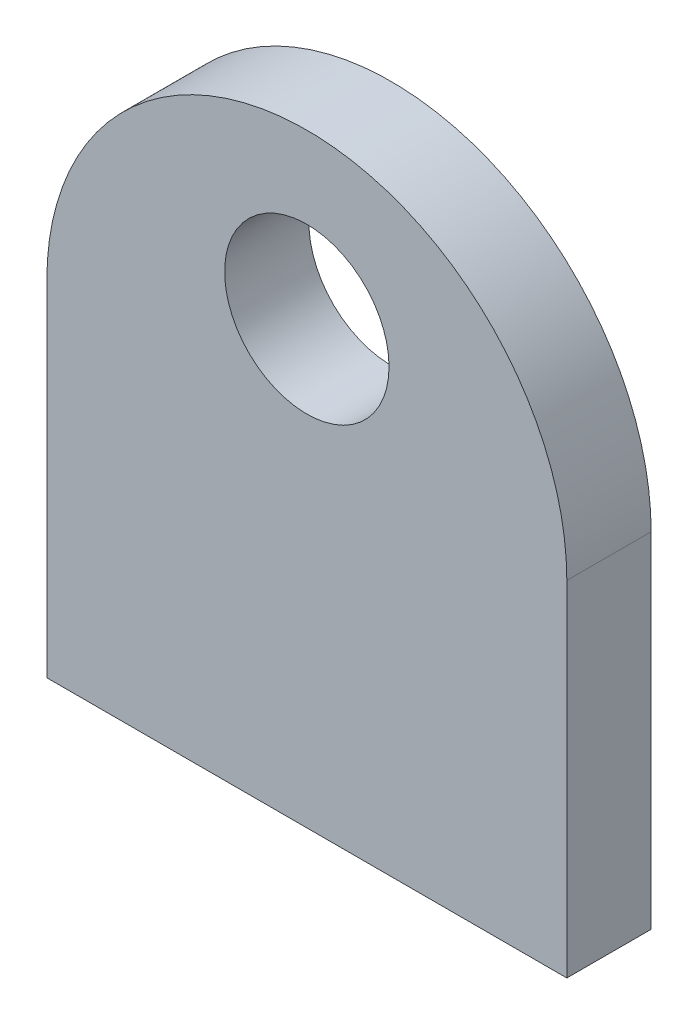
from build123d import *

# Parameters (mm, degrees)
SKETCH1_R           = 5.85
BOSS_EXTRUDE1_DEPTH = 6
SKETCH2_W           = 37
SKETCH2_H           = 4
BOSS_EXTRUDE2_DEPTH = 42
SKETCH3_W           = 1.5
SKETCH3_H           = 18
CUT_EXTRUDE1_DEPTH  = 10
SKETCH4_W           = 39.480550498
SKETCH4_H           = 39.048556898
CUT_EXTRUDE2_DEPTH  = 10


with BuildPart() as part:
    # Sketch1 → Boss-Extrude1 (new body)
    with BuildSketch(Plane.XY):
        with BuildLine():
            Line((-9.110395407, -22.5), (-9.110395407, -24.5))
            Line((-9.110395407, -24.5), (-46.110395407, -24.5))
            Line((-46.110395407, -24.5), (-46.110395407, -22.5))
            Line((-46.110395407, -22.5), (-46.110395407, 0))
            ThreePointArc((-46.110395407, 0), (-27.610395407, 18.5), (-9.110395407, 0))
            Line((-9.110395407, 0), (-9.110395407, -22.5))
        make_face()
        with Locations((-27.610395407, 6.85)):
            Circle(SKETCH1_R, mode=Mode.SUBTRACT)
    extrude(amount=BOSS_EXTRUDE1_DEPTH)

    # Sketch2 → Boss-Extrude2 (add)
    with BuildSketch(Plane.XY):
        with Locations((-27.610395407, -20.5)):
            Rectangle(SKETCH2_W, SKETCH2_H)
    extrude(amount=BOSS_EXTRUDE2_DEPTH)

    # Sketch3 → Cut-Extrude1 (cut)
    with BuildSketch(Plane(origin=(0, -18.5, 0), x_dir=(1, 0, 0), z_dir=(0, 1, 0))):
        with Locations((-9.860395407, -33)):
            Rectangle(SKETCH3_W, SKETCH3_H)
        with Locations((-45.360395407, -33)):
            Rectangle(SKETCH3_W, SKETCH3_H)
    extrude(amount=-CUT_EXTRUDE1_DEPTH, mode=Mode.SUBTRACT)

    # Sketch4 → Cut-Extrude2 (cut)
    with BuildSketch(Plane(origin=(0, -18.5, 0), x_dir=(1, 0, 0), z_dir=(0, 1, 0))):
        with Locations((-28.850670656, -25.524278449)):
            Rectangle(SKETCH4_W, SKETCH4_H)
    extrude(amount=-CUT_EXTRUDE2_DEPTH, mode=Mode.SUBTRACT)


solid = part.part
